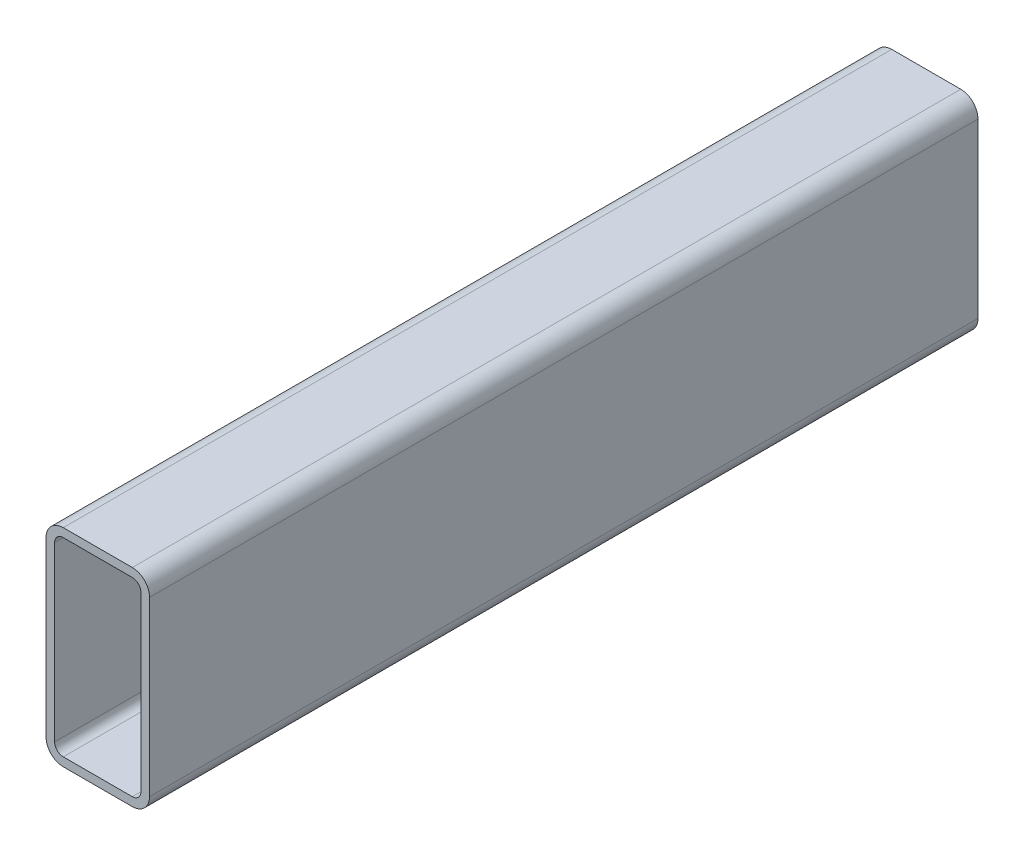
ISO-10303-21;
HEADER;
FILE_DESCRIPTION(('STEP AP214'),'2;1');
FILE_NAME('part.step','',(''),(''),'','','');
FILE_SCHEMA(('AUTOMOTIVE_DESIGN { 1 0 10303 214 1 1 1 1 }'));
ENDSEC;
DATA;
#1=APPLICATION_CONTEXT('core data for automotive mechanical design processes');
#2=APPLICATION_PROTOCOL_DEFINITION('international standard','automotive_design',2000,#1);
#3=PRODUCT_CONTEXT('',#1,'mechanical');
#4=PRODUCT('Part','Part','',(#3));
#5=PRODUCT_RELATED_PRODUCT_CATEGORY('part','',(#4));
#6=PRODUCT_DEFINITION_FORMATION('','',#4);
#7=PRODUCT_DEFINITION_CONTEXT('part definition',#1,'design');
#8=PRODUCT_DEFINITION('design','',#6,#7);
#9=PRODUCT_DEFINITION_SHAPE('','',#8);
#10=(LENGTH_UNIT() NAMED_UNIT(*) SI_UNIT(.MILLI.,.METRE.));
#11=(NAMED_UNIT(*) PLANE_ANGLE_UNIT() SI_UNIT($,.RADIAN.));
#12=(NAMED_UNIT(*) SI_UNIT($,.STERADIAN.) SOLID_ANGLE_UNIT());
#13=UNCERTAINTY_MEASURE_WITH_UNIT(LENGTH_MEASURE(1.E-05),#10,'distance_accuracy_value','');
#14=(GEOMETRIC_REPRESENTATION_CONTEXT(3) GLOBAL_UNCERTAINTY_ASSIGNED_CONTEXT((#13)) GLOBAL_UNIT_ASSIGNED_CONTEXT((#10,
#11,#12)) REPRESENTATION_CONTEXT('',''));
#15=CARTESIAN_POINT('',(0.,0.,0.));
#16=DIRECTION('',(0.,0.,1.));
#17=DIRECTION('',(1.,0.,0.));
#18=AXIS2_PLACEMENT_3D('',#15,#16,#17);
#19=CARTESIAN_POINT('',(6.35,69.85,304.8));
#20=DIRECTION('',(0.,0.,1.));
#21=DIRECTION('',(1.,0.,0.));
#22=AXIS2_PLACEMENT_3D('',#19,#20,#21);
#23=PLANE('',#22);
#24=CARTESIAN_POINT('',(6.35,69.85,304.8));
#25=DIRECTION('',(0.,0.,1.));
#26=DIRECTION('',(1.,0.,0.));
#27=AXIS2_PLACEMENT_3D('',#24,#25,#26);
#28=CIRCLE('',#27,6.35);
#29=CARTESIAN_POINT('',(6.35,76.2,304.8));
#30=VERTEX_POINT('',#29);
#31=CARTESIAN_POINT('',(0.,69.85,304.8));
#32=VERTEX_POINT('',#31);
#33=EDGE_CURVE('E211',#30,#32,#28,.T.);
#34=ORIENTED_EDGE('',*,*,#33,.T.);
#35=DIRECTION('',(0.,-1.,0.));
#36=VECTOR('',#35,1.);
#37=CARTESIAN_POINT('',(0.,69.85,304.8));
#38=LINE('',#37,#36);
#39=CARTESIAN_POINT('',(0.,6.35,304.8));
#40=VERTEX_POINT('',#39);
#41=EDGE_CURVE('E214',#32,#40,#38,.T.);
#42=ORIENTED_EDGE('',*,*,#41,.T.);
#43=CARTESIAN_POINT('',(6.35,6.35,304.8));
#44=DIRECTION('',(0.,0.,1.));
#45=DIRECTION('',(1.,0.,0.));
#46=AXIS2_PLACEMENT_3D('',#43,#44,#45);
#47=CIRCLE('',#46,6.35);
#48=CARTESIAN_POINT('',(6.35,0.,304.8));
#49=VERTEX_POINT('',#48);
#50=EDGE_CURVE('E217',#40,#49,#47,.T.);
#51=ORIENTED_EDGE('',*,*,#50,.T.);
#52=DIRECTION('',(1.,0.,0.));
#53=VECTOR('',#52,1.);
#54=CARTESIAN_POINT('',(6.35,0.,304.8));
#55=LINE('',#54,#53);
#56=CARTESIAN_POINT('',(31.75,0.,304.8));
#57=VERTEX_POINT('',#56);
#58=EDGE_CURVE('E219',#49,#57,#55,.T.);
#59=ORIENTED_EDGE('',*,*,#58,.T.);
#60=CARTESIAN_POINT('',(31.75,6.35,304.8));
#61=DIRECTION('',(0.,0.,1.));
#62=DIRECTION('',(1.,0.,0.));
#63=AXIS2_PLACEMENT_3D('',#60,#61,#62);
#64=CIRCLE('',#63,6.35);
#65=CARTESIAN_POINT('',(38.1,6.35,304.8));
#66=VERTEX_POINT('',#65);
#67=EDGE_CURVE('E221',#57,#66,#64,.T.);
#68=ORIENTED_EDGE('',*,*,#67,.T.);
#69=DIRECTION('',(0.,1.,0.));
#70=VECTOR('',#69,1.);
#71=CARTESIAN_POINT('',(38.1,6.35,304.8));
#72=LINE('',#71,#70);
#73=CARTESIAN_POINT('',(38.1,69.85,304.8));
#74=VERTEX_POINT('',#73);
#75=EDGE_CURVE('E223',#66,#74,#72,.T.);
#76=ORIENTED_EDGE('',*,*,#75,.T.);
#77=CARTESIAN_POINT('',(31.75,69.85,304.8));
#78=DIRECTION('',(0.,0.,1.));
#79=DIRECTION('',(1.,0.,0.));
#80=AXIS2_PLACEMENT_3D('',#77,#78,#79);
#81=CIRCLE('',#80,6.35000000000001);
#82=CARTESIAN_POINT('',(31.75,76.2,304.8));
#83=VERTEX_POINT('',#82);
#84=EDGE_CURVE('E225',#74,#83,#81,.T.);
#85=ORIENTED_EDGE('',*,*,#84,.T.);
#86=DIRECTION('',(-1.,0.,0.));
#87=VECTOR('',#86,1.);
#88=CARTESIAN_POINT('',(31.75,76.2,304.8));
#89=LINE('',#88,#87);
#90=EDGE_CURVE('E227',#83,#30,#89,.T.);
#91=ORIENTED_EDGE('',*,*,#90,.T.);
#92=EDGE_LOOP('',(#34,#42,#51,#59,#68,#76,#85,#91));
#93=FACE_BOUND('',#92,.T.);
#94=DIRECTION('',(0.,-1.,0.));
#95=VECTOR('',#94,1.);
#96=CARTESIAN_POINT('',(3.175,6.35,304.8));
#97=LINE('',#96,#95);
#98=CARTESIAN_POINT('',(3.175,69.85,304.8));
#99=VERTEX_POINT('',#98);
#100=CARTESIAN_POINT('',(3.175,6.35,304.8));
#101=VERTEX_POINT('',#100);
#102=EDGE_CURVE('E154',#99,#101,#97,.T.);
#103=ORIENTED_EDGE('',*,*,#102,.F.);
#104=CARTESIAN_POINT('',(6.35,69.85,304.8));
#105=DIRECTION('',(0.,0.,1.));
#106=DIRECTION('',(1.,0.,0.));
#107=AXIS2_PLACEMENT_3D('',#104,#105,#106);
#108=CIRCLE('',#107,3.175);
#109=CARTESIAN_POINT('',(6.35,73.025,304.8));
#110=VERTEX_POINT('',#109);
#111=EDGE_CURVE('E146',#110,#99,#108,.T.);
#112=ORIENTED_EDGE('',*,*,#111,.F.);
#113=DIRECTION('',(-1.,0.,0.));
#114=VECTOR('',#113,1.);
#115=CARTESIAN_POINT('',(6.35,73.025,304.8));
#116=LINE('',#115,#114);
#117=CARTESIAN_POINT('',(31.75,73.025,304.8));
#118=VERTEX_POINT('',#117);
#119=EDGE_CURVE('E179',#118,#110,#116,.T.);
#120=ORIENTED_EDGE('',*,*,#119,.F.);
#121=CARTESIAN_POINT('',(31.75,69.85,304.8));
#122=DIRECTION('',(0.,0.,1.));
#123=DIRECTION('',(1.,0.,0.));
#124=AXIS2_PLACEMENT_3D('',#121,#122,#123);
#125=CIRCLE('',#124,3.175);
#126=CARTESIAN_POINT('',(34.925,69.85,304.8));
#127=VERTEX_POINT('',#126);
#128=EDGE_CURVE('E177',#127,#118,#125,.T.);
#129=ORIENTED_EDGE('',*,*,#128,.F.);
#130=DIRECTION('',(0.,1.,0.));
#131=VECTOR('',#130,1.);
#132=CARTESIAN_POINT('',(34.925,69.85,304.8));
#133=LINE('',#132,#131);
#134=CARTESIAN_POINT('',(34.925,6.35,304.8));
#135=VERTEX_POINT('',#134);
#136=EDGE_CURVE('E175',#135,#127,#133,.T.);
#137=ORIENTED_EDGE('',*,*,#136,.F.);
#138=CARTESIAN_POINT('',(31.75,6.35,304.8));
#139=DIRECTION('',(0.,0.,1.));
#140=DIRECTION('',(1.,0.,0.));
#141=AXIS2_PLACEMENT_3D('',#138,#139,#140);
#142=CIRCLE('',#141,3.175);
#143=CARTESIAN_POINT('',(31.75,3.175,304.8));
#144=VERTEX_POINT('',#143);
#145=EDGE_CURVE('E173',#144,#135,#142,.T.);
#146=ORIENTED_EDGE('',*,*,#145,.F.);
#147=DIRECTION('',(1.,0.,0.));
#148=VECTOR('',#147,1.);
#149=CARTESIAN_POINT('',(31.75,3.175,304.8));
#150=LINE('',#149,#148);
#151=CARTESIAN_POINT('',(6.35,3.175,304.8));
#152=VERTEX_POINT('',#151);
#153=EDGE_CURVE('E169',#152,#144,#150,.T.);
#154=ORIENTED_EDGE('',*,*,#153,.F.);
#155=CARTESIAN_POINT('',(6.35,6.35,304.8));
#156=DIRECTION('',(0.,0.,1.));
#157=DIRECTION('',(1.,0.,0.));
#158=AXIS2_PLACEMENT_3D('',#155,#156,#157);
#159=CIRCLE('',#158,3.175);
#160=EDGE_CURVE('E167',#101,#152,#159,.T.);
#161=ORIENTED_EDGE('',*,*,#160,.F.);
#162=EDGE_LOOP('',(#103,#112,#120,#129,#137,#146,#154,#161));
#163=FACE_BOUND('',#162,.T.);
#164=ADVANCED_FACE('F33',(#93,#163),#23,.T.);
#165=CARTESIAN_POINT('',(6.35,69.85,0.));
#166=DIRECTION('',(0.,0.,1.));
#167=DIRECTION('',(1.,0.,0.));
#168=AXIS2_PLACEMENT_3D('',#165,#166,#167);
#169=PLANE('',#168);
#170=CARTESIAN_POINT('',(6.35,69.85,0.));
#171=DIRECTION('',(0.,0.,1.));
#172=DIRECTION('',(1.,0.,0.));
#173=AXIS2_PLACEMENT_3D('',#170,#171,#172);
#174=CIRCLE('',#173,6.35);
#175=CARTESIAN_POINT('',(6.35,76.2,0.));
#176=VERTEX_POINT('',#175);
#177=CARTESIAN_POINT('',(0.,69.85,0.));
#178=VERTEX_POINT('',#177);
#179=EDGE_CURVE('E162',#176,#178,#174,.T.);
#180=ORIENTED_EDGE('',*,*,#179,.F.);
#181=DIRECTION('',(-1.,0.,0.));
#182=VECTOR('',#181,1.);
#183=CARTESIAN_POINT('',(31.75,76.2,0.));
#184=LINE('',#183,#182);
#185=CARTESIAN_POINT('',(31.75,76.2,0.));
#186=VERTEX_POINT('',#185);
#187=EDGE_CURVE('E215',#186,#176,#184,.T.);
#188=ORIENTED_EDGE('',*,*,#187,.F.);
#189=CARTESIAN_POINT('',(31.75,69.85,0.));
#190=DIRECTION('',(0.,0.,1.));
#191=DIRECTION('',(1.,0.,0.));
#192=AXIS2_PLACEMENT_3D('',#189,#190,#191);
#193=CIRCLE('',#192,6.35000000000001);
#194=CARTESIAN_POINT('',(38.1,69.85,0.));
#195=VERTEX_POINT('',#194);
#196=EDGE_CURVE('E242',#195,#186,#193,.T.);
#197=ORIENTED_EDGE('',*,*,#196,.F.);
#198=DIRECTION('',(0.,1.,0.));
#199=VECTOR('',#198,1.);
#200=CARTESIAN_POINT('',(38.1,6.35,0.));
#201=LINE('',#200,#199);
#202=CARTESIAN_POINT('',(38.1,6.35,0.));
#203=VERTEX_POINT('',#202);
#204=EDGE_CURVE('E240',#203,#195,#201,.T.);
#205=ORIENTED_EDGE('',*,*,#204,.F.);
#206=CARTESIAN_POINT('',(31.75,6.35,0.));
#207=DIRECTION('',(0.,0.,1.));
#208=DIRECTION('',(1.,0.,0.));
#209=AXIS2_PLACEMENT_3D('',#206,#207,#208);
#210=CIRCLE('',#209,6.35);
#211=CARTESIAN_POINT('',(31.75,0.,0.));
#212=VERTEX_POINT('',#211);
#213=EDGE_CURVE('E238',#212,#203,#210,.T.);
#214=ORIENTED_EDGE('',*,*,#213,.F.);
#215=DIRECTION('',(1.,0.,0.));
#216=VECTOR('',#215,1.);
#217=CARTESIAN_POINT('',(6.35,0.,0.));
#218=LINE('',#217,#216);
#219=CARTESIAN_POINT('',(6.35,0.,0.));
#220=VERTEX_POINT('',#219);
#221=EDGE_CURVE('E236',#220,#212,#218,.T.);
#222=ORIENTED_EDGE('',*,*,#221,.F.);
#223=CARTESIAN_POINT('',(6.35,6.35,0.));
#224=DIRECTION('',(0.,0.,1.));
#225=DIRECTION('',(1.,0.,0.));
#226=AXIS2_PLACEMENT_3D('',#223,#224,#225);
#227=CIRCLE('',#226,6.35);
#228=CARTESIAN_POINT('',(0.,6.35,0.));
#229=VERTEX_POINT('',#228);
#230=EDGE_CURVE('E234',#229,#220,#227,.T.);
#231=ORIENTED_EDGE('',*,*,#230,.F.);
#232=DIRECTION('',(0.,-1.,0.));
#233=VECTOR('',#232,1.);
#234=CARTESIAN_POINT('',(0.,69.85,0.));
#235=LINE('',#234,#233);
#236=EDGE_CURVE('E232',#178,#229,#235,.T.);
#237=ORIENTED_EDGE('',*,*,#236,.F.);
#238=EDGE_LOOP('',(#180,#188,#197,#205,#214,#222,#231,#237));
#239=FACE_BOUND('',#238,.T.);
#240=CARTESIAN_POINT('',(6.35,69.85,0.));
#241=DIRECTION('',(0.,0.,1.));
#242=DIRECTION('',(1.,0.,0.));
#243=AXIS2_PLACEMENT_3D('',#240,#241,#242);
#244=CIRCLE('',#243,3.175);
#245=CARTESIAN_POINT('',(6.35,73.025,0.));
#246=VERTEX_POINT('',#245);
#247=CARTESIAN_POINT('',(3.175,69.85,0.));
#248=VERTEX_POINT('',#247);
#249=EDGE_CURVE('E56',#246,#248,#244,.T.);
#250=ORIENTED_EDGE('',*,*,#249,.T.);
#251=DIRECTION('',(0.,-1.,0.));
#252=VECTOR('',#251,1.);
#253=CARTESIAN_POINT('',(3.175,6.35,0.));
#254=LINE('',#253,#252);
#255=CARTESIAN_POINT('',(3.175,6.35,0.));
#256=VERTEX_POINT('',#255);
#257=EDGE_CURVE('E161',#248,#256,#254,.T.);
#258=ORIENTED_EDGE('',*,*,#257,.T.);
#259=CARTESIAN_POINT('',(6.35,6.35,0.));
#260=DIRECTION('',(0.,0.,1.));
#261=DIRECTION('',(1.,0.,0.));
#262=AXIS2_PLACEMENT_3D('',#259,#260,#261);
#263=CIRCLE('',#262,3.175);
#264=CARTESIAN_POINT('',(6.35,3.175,0.));
#265=VERTEX_POINT('',#264);
#266=EDGE_CURVE('E183',#256,#265,#263,.T.);
#267=ORIENTED_EDGE('',*,*,#266,.T.);
#268=DIRECTION('',(1.,0.,0.));
#269=VECTOR('',#268,1.);
#270=CARTESIAN_POINT('',(31.75,3.175,0.));
#271=LINE('',#270,#269);
#272=CARTESIAN_POINT('',(31.75,3.175,0.));
#273=VERTEX_POINT('',#272);
#274=EDGE_CURVE('E186',#265,#273,#271,.T.);
#275=ORIENTED_EDGE('',*,*,#274,.T.);
#276=CARTESIAN_POINT('',(31.75,6.35,0.));
#277=DIRECTION('',(0.,0.,1.));
#278=DIRECTION('',(1.,0.,0.));
#279=AXIS2_PLACEMENT_3D('',#276,#277,#278);
#280=CIRCLE('',#279,3.175);
#281=CARTESIAN_POINT('',(34.925,6.35,0.));
#282=VERTEX_POINT('',#281);
#283=EDGE_CURVE('E189',#273,#282,#280,.T.);
#284=ORIENTED_EDGE('',*,*,#283,.T.);
#285=DIRECTION('',(0.,1.,0.));
#286=VECTOR('',#285,1.);
#287=CARTESIAN_POINT('',(34.925,69.85,0.));
#288=LINE('',#287,#286);
#289=CARTESIAN_POINT('',(34.925,69.85,0.));
#290=VERTEX_POINT('',#289);
#291=EDGE_CURVE('E192',#282,#290,#288,.T.);
#292=ORIENTED_EDGE('',*,*,#291,.T.);
#293=CARTESIAN_POINT('',(31.75,69.85,0.));
#294=DIRECTION('',(0.,0.,1.));
#295=DIRECTION('',(1.,0.,0.));
#296=AXIS2_PLACEMENT_3D('',#293,#294,#295);
#297=CIRCLE('',#296,3.175);
#298=CARTESIAN_POINT('',(31.75,73.025,0.));
#299=VERTEX_POINT('',#298);
#300=EDGE_CURVE('E195',#290,#299,#297,.T.);
#301=ORIENTED_EDGE('',*,*,#300,.T.);
#302=DIRECTION('',(-1.,0.,0.));
#303=VECTOR('',#302,1.);
#304=CARTESIAN_POINT('',(6.35,73.025,0.));
#305=LINE('',#304,#303);
#306=EDGE_CURVE('E155',#299,#246,#305,.T.);
#307=ORIENTED_EDGE('',*,*,#306,.T.);
#308=EDGE_LOOP('',(#250,#258,#267,#275,#284,#292,#301,#307));
#309=FACE_BOUND('',#308,.T.);
#310=ADVANCED_FACE('F272',(#239,#309),#169,.F.);
#311=CARTESIAN_POINT('',(6.35,69.85,304.8));
#312=DIRECTION('',(0.,0.,-1.));
#313=DIRECTION('',(-1.,0.,0.));
#314=AXIS2_PLACEMENT_3D('',#311,#312,#313);
#315=CYLINDRICAL_SURFACE('',#314,6.35);
#316=ORIENTED_EDGE('',*,*,#179,.T.);
#317=DIRECTION('',(0.,0.,-1.));
#318=VECTOR('',#317,1.);
#319=CARTESIAN_POINT('',(0.,69.85,304.8));
#320=LINE('',#319,#318);
#321=EDGE_CURVE('E11',#32,#178,#320,.T.);
#322=ORIENTED_EDGE('',*,*,#321,.F.);
#323=ORIENTED_EDGE('',*,*,#33,.F.);
#324=DIRECTION('',(0.,0.,-1.));
#325=VECTOR('',#324,1.);
#326=CARTESIAN_POINT('',(6.35,76.2,304.8));
#327=LINE('',#326,#325);
#328=EDGE_CURVE('E229',#30,#176,#327,.T.);
#329=ORIENTED_EDGE('',*,*,#328,.T.);
#330=EDGE_LOOP('',(#316,#322,#323,#329));
#331=FACE_BOUND('',#330,.T.);
#332=ADVANCED_FACE('F35',(#331),#315,.T.);
#333=CARTESIAN_POINT('',(0.,69.85,304.8));
#334=DIRECTION('',(1.,0.,0.));
#335=DIRECTION('',(0.,0.,-1.));
#336=AXIS2_PLACEMENT_3D('',#333,#334,#335);
#337=PLANE('',#336);
#338=ORIENTED_EDGE('',*,*,#236,.T.);
#339=DIRECTION('',(0.,0.,-1.));
#340=VECTOR('',#339,1.);
#341=CARTESIAN_POINT('',(0.,6.35,304.8));
#342=LINE('',#341,#340);
#343=EDGE_CURVE('E41',#40,#229,#342,.T.);
#344=ORIENTED_EDGE('',*,*,#343,.F.);
#345=ORIENTED_EDGE('',*,*,#41,.F.);
#346=ORIENTED_EDGE('',*,*,#321,.T.);
#347=EDGE_LOOP('',(#338,#344,#345,#346));
#348=FACE_BOUND('',#347,.T.);
#349=ADVANCED_FACE('F289',(#348),#337,.F.);
#350=CARTESIAN_POINT('',(6.35,6.35,304.8));
#351=DIRECTION('',(0.,0.,-1.));
#352=DIRECTION('',(-1.,0.,0.));
#353=AXIS2_PLACEMENT_3D('',#350,#351,#352);
#354=CYLINDRICAL_SURFACE('',#353,6.35);
#355=ORIENTED_EDGE('',*,*,#230,.T.);
#356=DIRECTION('',(0.,0.,-1.));
#357=VECTOR('',#356,1.);
#358=CARTESIAN_POINT('',(6.35,0.,304.8));
#359=LINE('',#358,#357);
#360=EDGE_CURVE('E259',#49,#220,#359,.T.);
#361=ORIENTED_EDGE('',*,*,#360,.F.);
#362=ORIENTED_EDGE('',*,*,#50,.F.);
#363=ORIENTED_EDGE('',*,*,#343,.T.);
#364=EDGE_LOOP('',(#355,#361,#362,#363));
#365=FACE_BOUND('',#364,.T.);
#366=ADVANCED_FACE('F266',(#365),#354,.T.);
#367=CARTESIAN_POINT('',(6.35,0.,304.8));
#368=DIRECTION('',(0.,1.,0.));
#369=DIRECTION('',(0.,0.,1.));
#370=AXIS2_PLACEMENT_3D('',#367,#368,#369);
#371=PLANE('',#370);
#372=ORIENTED_EDGE('',*,*,#221,.T.);
#373=DIRECTION('',(0.,0.,-1.));
#374=VECTOR('',#373,1.);
#375=CARTESIAN_POINT('',(31.75,0.,304.8));
#376=LINE('',#375,#374);
#377=EDGE_CURVE('E256',#57,#212,#376,.T.);
#378=ORIENTED_EDGE('',*,*,#377,.F.);
#379=ORIENTED_EDGE('',*,*,#58,.F.);
#380=ORIENTED_EDGE('',*,*,#360,.T.);
#381=EDGE_LOOP('',(#372,#378,#379,#380));
#382=FACE_BOUND('',#381,.T.);
#383=ADVANCED_FACE('F278',(#382),#371,.F.);
#384=CARTESIAN_POINT('',(31.75,6.35,304.8));
#385=DIRECTION('',(0.,0.,-1.));
#386=DIRECTION('',(-1.,0.,0.));
#387=AXIS2_PLACEMENT_3D('',#384,#385,#386);
#388=CYLINDRICAL_SURFACE('',#387,6.35);
#389=ORIENTED_EDGE('',*,*,#213,.T.);
#390=DIRECTION('',(0.,0.,-1.));
#391=VECTOR('',#390,1.);
#392=CARTESIAN_POINT('',(38.1,6.35,304.8));
#393=LINE('',#392,#391);
#394=EDGE_CURVE('E253',#66,#203,#393,.T.);
#395=ORIENTED_EDGE('',*,*,#394,.F.);
#396=ORIENTED_EDGE('',*,*,#67,.F.);
#397=ORIENTED_EDGE('',*,*,#377,.T.);
#398=EDGE_LOOP('',(#389,#395,#396,#397));
#399=FACE_BOUND('',#398,.T.);
#400=ADVANCED_FACE('F282',(#399),#388,.T.);
#401=CARTESIAN_POINT('',(38.1,6.35,304.8));
#402=DIRECTION('',(-1.,0.,0.));
#403=DIRECTION('',(0.,0.,1.));
#404=AXIS2_PLACEMENT_3D('',#401,#402,#403);
#405=PLANE('',#404);
#406=ORIENTED_EDGE('',*,*,#204,.T.);
#407=DIRECTION('',(0.,0.,-1.));
#408=VECTOR('',#407,1.);
#409=CARTESIAN_POINT('',(38.1,69.85,304.8));
#410=LINE('',#409,#408);
#411=EDGE_CURVE('E250',#74,#195,#410,.T.);
#412=ORIENTED_EDGE('',*,*,#411,.F.);
#413=ORIENTED_EDGE('',*,*,#75,.F.);
#414=ORIENTED_EDGE('',*,*,#394,.T.);
#415=EDGE_LOOP('',(#406,#412,#413,#414));
#416=FACE_BOUND('',#415,.T.);
#417=ADVANCED_FACE('F302',(#416),#405,.F.);
#418=CARTESIAN_POINT('',(31.75,69.85,304.8));
#419=DIRECTION('',(0.,0.,-1.));
#420=DIRECTION('',(-1.,0.,0.));
#421=AXIS2_PLACEMENT_3D('',#418,#419,#420);
#422=CYLINDRICAL_SURFACE('',#421,6.35000000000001);
#423=ORIENTED_EDGE('',*,*,#196,.T.);
#424=DIRECTION('',(0.,0.,-1.));
#425=VECTOR('',#424,1.);
#426=CARTESIAN_POINT('',(31.75,76.2,304.8));
#427=LINE('',#426,#425);
#428=EDGE_CURVE('E247',#83,#186,#427,.T.);
#429=ORIENTED_EDGE('',*,*,#428,.F.);
#430=ORIENTED_EDGE('',*,*,#84,.F.);
#431=ORIENTED_EDGE('',*,*,#411,.T.);
#432=EDGE_LOOP('',(#423,#429,#430,#431));
#433=FACE_BOUND('',#432,.T.);
#434=ADVANCED_FACE('F300',(#433),#422,.T.);
#435=CARTESIAN_POINT('',(31.75,76.2,304.8));
#436=DIRECTION('',(0.,-1.,0.));
#437=DIRECTION('',(0.,0.,-1.));
#438=AXIS2_PLACEMENT_3D('',#435,#436,#437);
#439=PLANE('',#438);
#440=ORIENTED_EDGE('',*,*,#187,.T.);
#441=ORIENTED_EDGE('',*,*,#328,.F.);
#442=ORIENTED_EDGE('',*,*,#90,.F.);
#443=ORIENTED_EDGE('',*,*,#428,.T.);
#444=EDGE_LOOP('',(#440,#441,#442,#443));
#445=FACE_BOUND('',#444,.T.);
#446=ADVANCED_FACE('F295',(#445),#439,.F.);
#447=CARTESIAN_POINT('',(6.35,69.85,304.8));
#448=DIRECTION('',(0.,0.,-1.));
#449=DIRECTION('',(-1.,0.,0.));
#450=AXIS2_PLACEMENT_3D('',#447,#448,#449);
#451=CYLINDRICAL_SURFACE('',#450,3.175);
#452=ORIENTED_EDGE('',*,*,#249,.F.);
#453=DIRECTION('',(0.,0.,-1.));
#454=VECTOR('',#453,1.);
#455=CARTESIAN_POINT('',(6.35,73.025,304.8));
#456=LINE('',#455,#454);
#457=EDGE_CURVE('E150',#110,#246,#456,.T.);
#458=ORIENTED_EDGE('',*,*,#457,.F.);
#459=ORIENTED_EDGE('',*,*,#111,.T.);
#460=DIRECTION('',(0.,0.,-1.));
#461=VECTOR('',#460,1.);
#462=CARTESIAN_POINT('',(3.175,69.85,304.8));
#463=LINE('',#462,#461);
#464=EDGE_CURVE('E149',#99,#248,#463,.T.);
#465=ORIENTED_EDGE('',*,*,#464,.T.);
#466=EDGE_LOOP('',(#452,#458,#459,#465));
#467=FACE_BOUND('',#466,.T.);
#468=ADVANCED_FACE('F148',(#467),#451,.F.);
#469=CARTESIAN_POINT('',(3.175,6.35,304.8));
#470=DIRECTION('',(1.,0.,0.));
#471=DIRECTION('',(0.,0.,-1.));
#472=AXIS2_PLACEMENT_3D('',#469,#470,#471);
#473=PLANE('',#472);
#474=ORIENTED_EDGE('',*,*,#257,.F.);
#475=ORIENTED_EDGE('',*,*,#464,.F.);
#476=ORIENTED_EDGE('',*,*,#102,.T.);
#477=DIRECTION('',(0.,0.,-1.));
#478=VECTOR('',#477,1.);
#479=CARTESIAN_POINT('',(3.175,6.35,304.8));
#480=LINE('',#479,#478);
#481=EDGE_CURVE('E163',#101,#256,#480,.T.);
#482=ORIENTED_EDGE('',*,*,#481,.T.);
#483=EDGE_LOOP('',(#474,#475,#476,#482));
#484=FACE_BOUND('',#483,.T.);
#485=ADVANCED_FACE('F158',(#484),#473,.T.);
#486=CARTESIAN_POINT('',(6.35,6.35,304.8));
#487=DIRECTION('',(0.,0.,-1.));
#488=DIRECTION('',(-1.,0.,0.));
#489=AXIS2_PLACEMENT_3D('',#486,#487,#488);
#490=CYLINDRICAL_SURFACE('',#489,3.175);
#491=ORIENTED_EDGE('',*,*,#266,.F.);
#492=ORIENTED_EDGE('',*,*,#481,.F.);
#493=ORIENTED_EDGE('',*,*,#160,.T.);
#494=DIRECTION('',(0.,0.,-1.));
#495=VECTOR('',#494,1.);
#496=CARTESIAN_POINT('',(6.35,3.175,304.8));
#497=LINE('',#496,#495);
#498=EDGE_CURVE('E208',#152,#265,#497,.T.);
#499=ORIENTED_EDGE('',*,*,#498,.T.);
#500=EDGE_LOOP('',(#491,#492,#493,#499));
#501=FACE_BOUND('',#500,.T.);
#502=ADVANCED_FACE('F327',(#501),#490,.F.);
#503=CARTESIAN_POINT('',(31.75,3.175,304.8));
#504=DIRECTION('',(0.,1.,0.));
#505=DIRECTION('',(0.,0.,1.));
#506=AXIS2_PLACEMENT_3D('',#503,#504,#505);
#507=PLANE('',#506);
#508=ORIENTED_EDGE('',*,*,#274,.F.);
#509=ORIENTED_EDGE('',*,*,#498,.F.);
#510=ORIENTED_EDGE('',*,*,#153,.T.);
#511=DIRECTION('',(0.,0.,-1.));
#512=VECTOR('',#511,1.);
#513=CARTESIAN_POINT('',(31.75,3.175,304.8));
#514=LINE('',#513,#512);
#515=EDGE_CURVE('E206',#144,#273,#514,.T.);
#516=ORIENTED_EDGE('',*,*,#515,.T.);
#517=EDGE_LOOP('',(#508,#509,#510,#516));
#518=FACE_BOUND('',#517,.T.);
#519=ADVANCED_FACE('F331',(#518),#507,.T.);
#520=CARTESIAN_POINT('',(31.75,6.35,304.8));
#521=DIRECTION('',(0.,0.,-1.));
#522=DIRECTION('',(-1.,0.,0.));
#523=AXIS2_PLACEMENT_3D('',#520,#521,#522);
#524=CYLINDRICAL_SURFACE('',#523,3.175);
#525=ORIENTED_EDGE('',*,*,#283,.F.);
#526=ORIENTED_EDGE('',*,*,#515,.F.);
#527=ORIENTED_EDGE('',*,*,#145,.T.);
#528=DIRECTION('',(0.,0.,-1.));
#529=VECTOR('',#528,1.);
#530=CARTESIAN_POINT('',(34.925,6.35,304.8));
#531=LINE('',#530,#529);
#532=EDGE_CURVE('E204',#135,#282,#531,.T.);
#533=ORIENTED_EDGE('',*,*,#532,.T.);
#534=EDGE_LOOP('',(#525,#526,#527,#533));
#535=FACE_BOUND('',#534,.T.);
#536=ADVANCED_FACE('F337',(#535),#524,.F.);
#537=CARTESIAN_POINT('',(34.925,69.85,304.8));
#538=DIRECTION('',(-1.,0.,0.));
#539=DIRECTION('',(0.,0.,1.));
#540=AXIS2_PLACEMENT_3D('',#537,#538,#539);
#541=PLANE('',#540);
#542=ORIENTED_EDGE('',*,*,#291,.F.);
#543=ORIENTED_EDGE('',*,*,#532,.F.);
#544=ORIENTED_EDGE('',*,*,#136,.T.);
#545=DIRECTION('',(0.,0.,-1.));
#546=VECTOR('',#545,1.);
#547=CARTESIAN_POINT('',(34.925,69.85,304.8));
#548=LINE('',#547,#546);
#549=EDGE_CURVE('E202',#127,#290,#548,.T.);
#550=ORIENTED_EDGE('',*,*,#549,.T.);
#551=EDGE_LOOP('',(#542,#543,#544,#550));
#552=FACE_BOUND('',#551,.T.);
#553=ADVANCED_FACE('F341',(#552),#541,.T.);
#554=CARTESIAN_POINT('',(31.75,69.85,304.8));
#555=DIRECTION('',(0.,0.,-1.));
#556=DIRECTION('',(-1.,0.,0.));
#557=AXIS2_PLACEMENT_3D('',#554,#555,#556);
#558=CYLINDRICAL_SURFACE('',#557,3.175);
#559=ORIENTED_EDGE('',*,*,#300,.F.);
#560=ORIENTED_EDGE('',*,*,#549,.F.);
#561=ORIENTED_EDGE('',*,*,#128,.T.);
#562=DIRECTION('',(0.,0.,-1.));
#563=VECTOR('',#562,1.);
#564=CARTESIAN_POINT('',(31.75,73.025,304.8));
#565=LINE('',#564,#563);
#566=EDGE_CURVE('E48',#118,#299,#565,.T.);
#567=ORIENTED_EDGE('',*,*,#566,.T.);
#568=EDGE_LOOP('',(#559,#560,#561,#567));
#569=FACE_BOUND('',#568,.T.);
#570=ADVANCED_FACE('F345',(#569),#558,.F.);
#571=CARTESIAN_POINT('',(6.35,73.025,304.8));
#572=DIRECTION('',(0.,-1.,0.));
#573=DIRECTION('',(0.,0.,-1.));
#574=AXIS2_PLACEMENT_3D('',#571,#572,#573);
#575=PLANE('',#574);
#576=ORIENTED_EDGE('',*,*,#306,.F.);
#577=ORIENTED_EDGE('',*,*,#566,.F.);
#578=ORIENTED_EDGE('',*,*,#119,.T.);
#579=ORIENTED_EDGE('',*,*,#457,.T.);
#580=EDGE_LOOP('',(#576,#577,#578,#579));
#581=FACE_BOUND('',#580,.T.);
#582=ADVANCED_FACE('F349',(#581),#575,.T.);
#583=CLOSED_SHELL('',(#164,#310,#332,#349,#366,#383,#400,#417,#434,#446,#468,#485,#502,#519,
#536,#553,#570,#582));
#584=MANIFOLD_SOLID_BREP('B2',#583);
#585=ADVANCED_BREP_SHAPE_REPRESENTATION('',(#18,#584),#14);
#586=SHAPE_DEFINITION_REPRESENTATION(#9,#585);
ENDSEC;
END-ISO-10303-21;
